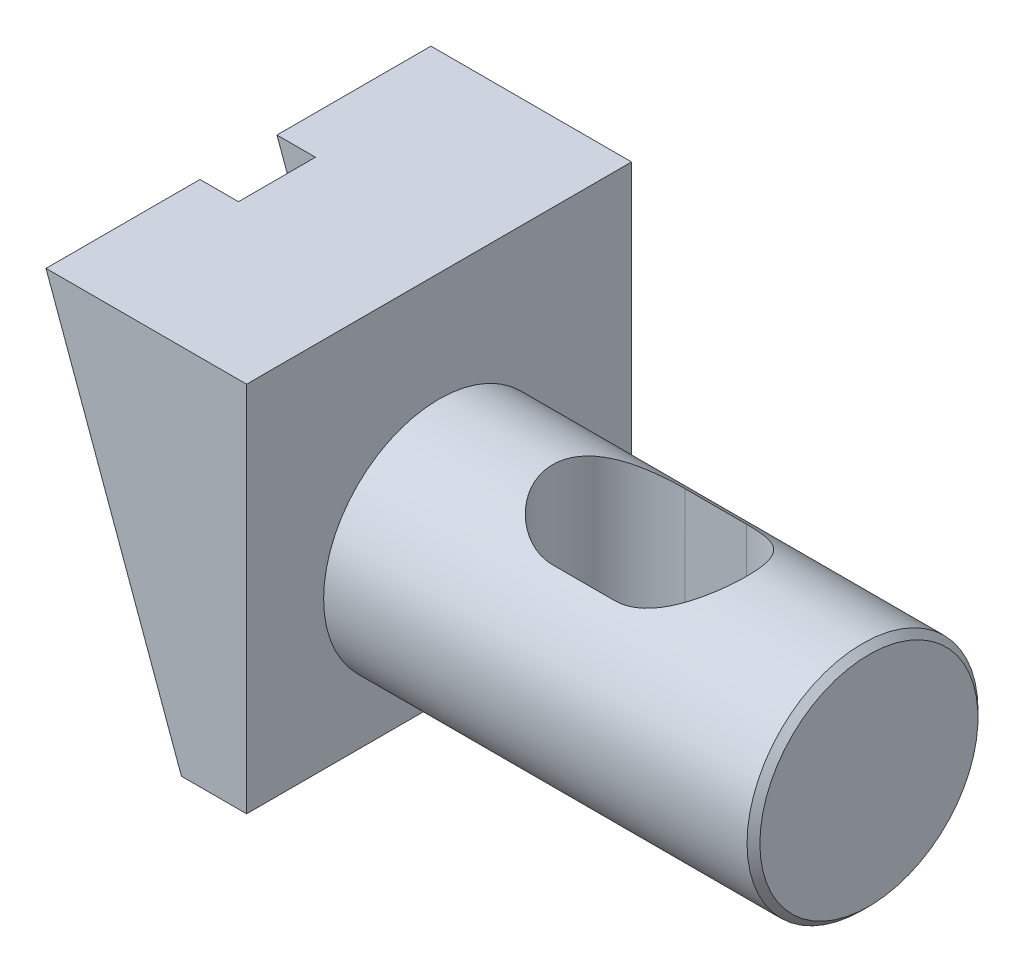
from build123d import *

# Parameters (mm, degrees)
EXTRUDE1_DEPTH          = 15
EXTRUDE1_DEPTH_BACK     = 15
CUT_EXTRUDE1_DEPTH      = 30
CUT_EXTRUDE2_DEPTH      = 3
CUT_EXTRUDE2_DEPTH_BACK = 3
SKETCH5_W               = 15
SKETCH5_H               = 8.5
SKETCH6_W               = 15
SKETCH6_H               = 7.5
CUT_EXTRUDE3_DEPTH      = 3


with BuildPart() as part:
    # Sketch1 → Revolve1 (revolve)
    with BuildSketch(Plane.XY, mode=Mode.PRIVATE) as revolve1_sk:
        Polygon((-33.5, 11.5), (-33.5, 20.5), (-0.5, 20.5), (0, 20), (0, 11.5), align=None)
    revolve(revolve1_sk.sketch.rotate(Axis((0, 11.5, 0), (-1, 0, 0)), 270), axis=Axis((0, 11.5, 0), (-1, 0, 0)))

    # Sketch2 → Extrude1 (add, two sides: drawn at the far end of the back side and taken through both)
    with BuildSketch(Plane.XY.offset(-EXTRUDE1_DEPTH_BACK)):
        Polygon((-49.136029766, 29), (-38.580892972, 0), (-33.5, 0), (-33.5, 29), align=None)
    extrude(amount=EXTRUDE1_DEPTH + EXTRUDE1_DEPTH_BACK)

    # Sketch3 → Cut-Extrude1 (cut)
    with BuildSketch(Plane(origin=(0, 0, 0), x_dir=(-1, 0, 0), z_dir=(0, 1, 0))):
        with BuildLine():
            Line((19.5, 5.15), (14.7, 5.15))
            ThreePointArc((14.7, 5.15), (9.55, 0), (14.7, -5.15))
            Line((14.7, -5.15), (19.5, -5.15))
            ThreePointArc((19.5, -5.15), (24.65, 0), (19.5, 5.15))
        make_face()
    extrude(amount=CUT_EXTRUDE1_DEPTH, mode=Mode.SUBTRACT)

    # Sketch4 → Cut-Extrude2 (cut, two sides: drawn at the far end of the back side and taken through both)
    with BuildSketch(Plane.XY.offset(-CUT_EXTRUDE2_DEPTH_BACK)):
        Polygon((-58.5, 0), (-35.580892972, 0), (-46.136029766, 29), (-58.5, 29), align=None)
    extrude(amount=CUT_EXTRUDE2_DEPTH + CUT_EXTRUDE2_DEPTH_BACK, mode=Mode.SUBTRACT)

    # Sketch5 → Cut-Revolve1 (revolve, cut)
    with BuildSketch(Plane.XY, mode=Mode.PRIVATE) as cut_revolve1_sk:
        with Locations((-43.6, 19.75)):
            Rectangle(SKETCH5_W, SKETCH5_H)
    revolve(cut_revolve1_sk.sketch.rotate(Axis((-36.1, 15.5, 0), (-1, 0, 0)), 270), axis=Axis((-36.1, 15.5, 0), (-1, 0, 0)), mode=Mode.SUBTRACT)

    # Sketch6 → Revolve2 (revolve)
    with BuildSketch(Plane.XY, mode=Mode.PRIVATE) as revolve2_sk:
        with Locations((-43.6, 19.25)):
            Rectangle(SKETCH6_W, SKETCH6_H)
    revolve(revolve2_sk.sketch.rotate(Axis((-36.1, 15.5, 0), (-1, 0, 0)), 270), axis=Axis((-36.1, 15.5, 0), (-1, 0, 0)))

    # Sketch7 → Revolve3 (revolve)
    with BuildSketch(Plane.XY, mode=Mode.PRIVATE) as revolve3_sk:
        with BuildLine():
            Line((-57.5, 15.5), (-57.5, 18.5))
            ThreePointArc((-57.5, 18.5), (-57.353553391, 18.853553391), (-57, 19))
            Line((-57, 19), (-53.5, 19))
            Line((-53.5, 19), (-53.5, 17.5))
            Line((-53.5, 17.5), (-47.9295, 17.5))
            Line((-47.9295, 17.5), (-47.5, 17.0705))
            Line((-47.5, 17.0705), (-47.5, 15.5))
            Line((-47.5, 15.5), (-57.5, 15.5))
        make_face()
    revolve(revolve3_sk.sketch.rotate(Axis((-47.5, 15.5, 0), (-1, 0, 0)), 270), axis=Axis((-47.5, 15.5, 0), (-1, 0, 0)))

    # Sketch8 → Cut-Extrude3 (cut)
    with BuildSketch(Plane.ZY.offset(57.5)):
        Polygon((-0.866025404, 14), (0.866025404, 14), (1.732050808, 15.5), (0.866025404, 17), (-0.866025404, 17), (-1.732050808, 15.5), align=None)
    extrude(amount=-CUT_EXTRUDE3_DEPTH, mode=Mode.SUBTRACT)


solid = part.part
